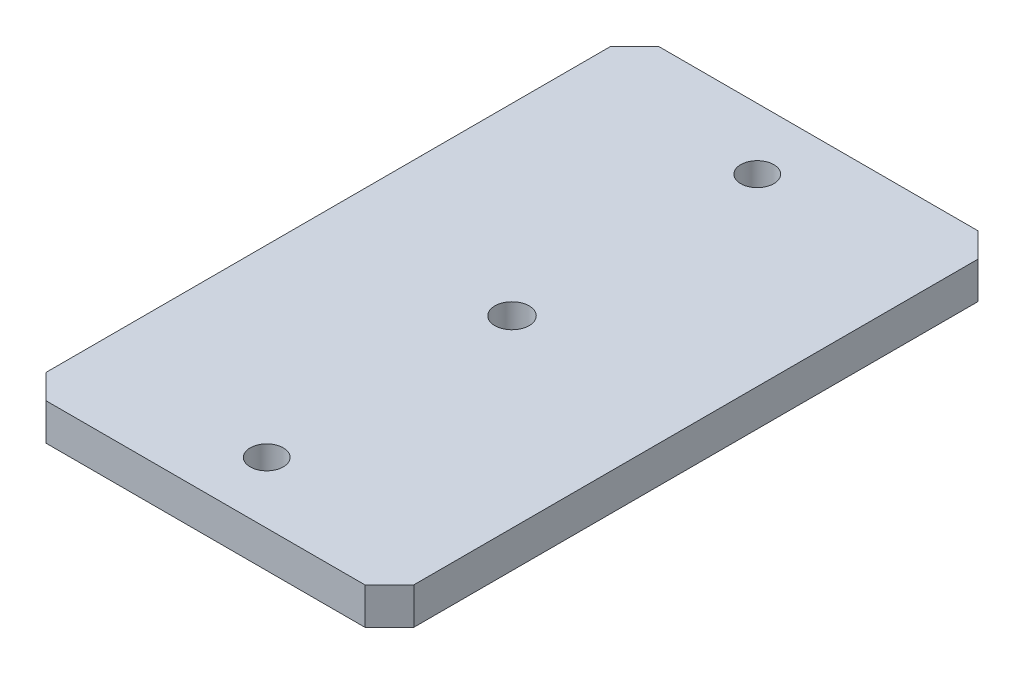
ISO-10303-21;
HEADER;
FILE_DESCRIPTION(('STEP AP214'),'2;1');
FILE_NAME('part.step','',(''),(''),'','','');
FILE_SCHEMA(('AUTOMOTIVE_DESIGN { 1 0 10303 214 1 1 1 1 }'));
ENDSEC;
DATA;
#1=APPLICATION_CONTEXT('core data for automotive mechanical design processes');
#2=APPLICATION_PROTOCOL_DEFINITION('international standard','automotive_design',2000,#1);
#3=PRODUCT_CONTEXT('',#1,'mechanical');
#4=PRODUCT('Part','Part','',(#3));
#5=PRODUCT_RELATED_PRODUCT_CATEGORY('part','',(#4));
#6=PRODUCT_DEFINITION_FORMATION('','',#4);
#7=PRODUCT_DEFINITION_CONTEXT('part definition',#1,'design');
#8=PRODUCT_DEFINITION('design','',#6,#7);
#9=PRODUCT_DEFINITION_SHAPE('','',#8);
#10=(LENGTH_UNIT() NAMED_UNIT(*) SI_UNIT(.MILLI.,.METRE.));
#11=(NAMED_UNIT(*) PLANE_ANGLE_UNIT() SI_UNIT($,.RADIAN.));
#12=(NAMED_UNIT(*) SI_UNIT($,.STERADIAN.) SOLID_ANGLE_UNIT());
#13=UNCERTAINTY_MEASURE_WITH_UNIT(LENGTH_MEASURE(1.E-05),#10,'distance_accuracy_value','');
#14=(GEOMETRIC_REPRESENTATION_CONTEXT(3) GLOBAL_UNCERTAINTY_ASSIGNED_CONTEXT((#13)) GLOBAL_UNIT_ASSIGNED_CONTEXT((#10,
#11,#12)) REPRESENTATION_CONTEXT('',''));
#15=CARTESIAN_POINT('',(0.,0.,0.));
#16=DIRECTION('',(0.,0.,1.));
#17=DIRECTION('',(1.,0.,0.));
#18=AXIS2_PLACEMENT_3D('',#15,#16,#17);
#19=CARTESIAN_POINT('',(-226.912230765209,15.,-125.));
#20=DIRECTION('',(0.,0.,-1.));
#21=DIRECTION('',(-1.,0.,0.));
#22=AXIS2_PLACEMENT_3D('',#19,#20,#21);
#23=PLANE('',#22);
#24=DIRECTION('',(1.,0.,0.));
#25=VECTOR('',#24,1.);
#26=CARTESIAN_POINT('',(-226.912230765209,0.,-125.));
#27=LINE('',#26,#25);
#28=CARTESIAN_POINT('',(-65.,0.,-125.));
#29=VERTEX_POINT('',#28);
#30=CARTESIAN_POINT('',(65.,0.,-125.));
#31=VERTEX_POINT('',#30);
#32=EDGE_CURVE('E123',#29,#31,#27,.T.);
#33=ORIENTED_EDGE('',*,*,#32,.F.);
#34=DIRECTION('',(0.,1.,0.));
#35=VECTOR('',#34,1.);
#36=CARTESIAN_POINT('',(-65.,15.,-125.));
#37=LINE('',#36,#35);
#38=CARTESIAN_POINT('',(-65.,15.,-125.));
#39=VERTEX_POINT('',#38);
#40=EDGE_CURVE('E144',#29,#39,#37,.T.);
#41=ORIENTED_EDGE('',*,*,#40,.T.);
#42=DIRECTION('',(1.,0.,0.));
#43=VECTOR('',#42,1.);
#44=CARTESIAN_POINT('',(-226.912230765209,15.,-125.));
#45=LINE('',#44,#43);
#46=CARTESIAN_POINT('',(64.9999999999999,15.,-125.));
#47=VERTEX_POINT('',#46);
#48=EDGE_CURVE('E161',#39,#47,#45,.T.);
#49=ORIENTED_EDGE('',*,*,#48,.T.);
#50=DIRECTION('',(0.,-1.,0.));
#51=VECTOR('',#50,1.);
#52=CARTESIAN_POINT('',(65.,15.,-125.));
#53=LINE('',#52,#51);
#54=EDGE_CURVE('E141',#47,#31,#53,.T.);
#55=ORIENTED_EDGE('',*,*,#54,.T.);
#56=EDGE_LOOP('',(#33,#41,#49,#55));
#57=FACE_BOUND('',#56,.T.);
#58=ADVANCED_FACE('F36',(#57),#23,.T.);
#59=CARTESIAN_POINT('',(-75.,15.,0.));
#60=DIRECTION('',(-1.,0.,0.));
#61=DIRECTION('',(0.,0.,1.));
#62=AXIS2_PLACEMENT_3D('',#59,#60,#61);
#63=PLANE('',#62);
#64=DIRECTION('',(0.,0.,-1.));
#65=VECTOR('',#64,1.);
#66=CARTESIAN_POINT('',(-75.,15.,0.));
#67=LINE('',#66,#65);
#68=CARTESIAN_POINT('',(-75.,15.,115.));
#69=VERTEX_POINT('',#68);
#70=CARTESIAN_POINT('',(-75.,15.,-115.));
#71=VERTEX_POINT('',#70);
#72=EDGE_CURVE('E159',#69,#71,#67,.T.);
#73=ORIENTED_EDGE('',*,*,#72,.T.);
#74=DIRECTION('',(0.,-1.,0.));
#75=VECTOR('',#74,1.);
#76=CARTESIAN_POINT('',(-75.,15.,-115.));
#77=LINE('',#76,#75);
#78=CARTESIAN_POINT('',(-75.,0.,-115.));
#79=VERTEX_POINT('',#78);
#80=EDGE_CURVE('E122',#71,#79,#77,.T.);
#81=ORIENTED_EDGE('',*,*,#80,.T.);
#82=DIRECTION('',(0.,0.,-1.));
#83=VECTOR('',#82,1.);
#84=CARTESIAN_POINT('',(-75.,0.,0.));
#85=LINE('',#84,#83);
#86=CARTESIAN_POINT('',(-75.,0.,115.));
#87=VERTEX_POINT('',#86);
#88=EDGE_CURVE('E105',#87,#79,#85,.T.);
#89=ORIENTED_EDGE('',*,*,#88,.F.);
#90=DIRECTION('',(0.,1.,0.));
#91=VECTOR('',#90,1.);
#92=CARTESIAN_POINT('',(-75.,15.,115.));
#93=LINE('',#92,#91);
#94=EDGE_CURVE('E119',#87,#69,#93,.T.);
#95=ORIENTED_EDGE('',*,*,#94,.T.);
#96=EDGE_LOOP('',(#73,#81,#89,#95));
#97=FACE_BOUND('',#96,.T.);
#98=ADVANCED_FACE('F118',(#97),#63,.T.);
#99=CARTESIAN_POINT('',(-226.912230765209,15.,125.));
#100=DIRECTION('',(0.,0.,1.));
#101=DIRECTION('',(1.,0.,0.));
#102=AXIS2_PLACEMENT_3D('',#99,#100,#101);
#103=PLANE('',#102);
#104=DIRECTION('',(-1.,0.,0.));
#105=VECTOR('',#104,1.);
#106=CARTESIAN_POINT('',(-226.912230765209,15.,125.));
#107=LINE('',#106,#105);
#108=CARTESIAN_POINT('',(64.9999999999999,15.,125.));
#109=VERTEX_POINT('',#108);
#110=CARTESIAN_POINT('',(-64.9999999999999,15.,125.));
#111=VERTEX_POINT('',#110);
#112=EDGE_CURVE('E132',#109,#111,#107,.T.);
#113=ORIENTED_EDGE('',*,*,#112,.T.);
#114=DIRECTION('',(0.,-1.,0.));
#115=VECTOR('',#114,1.);
#116=CARTESIAN_POINT('',(-65.,15.,125.));
#117=LINE('',#116,#115);
#118=CARTESIAN_POINT('',(-65.,0.,125.));
#119=VERTEX_POINT('',#118);
#120=EDGE_CURVE('E154',#111,#119,#117,.T.);
#121=ORIENTED_EDGE('',*,*,#120,.T.);
#122=DIRECTION('',(-1.,0.,0.));
#123=VECTOR('',#122,1.);
#124=CARTESIAN_POINT('',(-226.912230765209,0.,125.));
#125=LINE('',#124,#123);
#126=CARTESIAN_POINT('',(64.9999999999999,0.,125.));
#127=VERTEX_POINT('',#126);
#128=EDGE_CURVE('E107',#127,#119,#125,.T.);
#129=ORIENTED_EDGE('',*,*,#128,.F.);
#130=DIRECTION('',(0.,1.,0.));
#131=VECTOR('',#130,1.);
#132=CARTESIAN_POINT('',(64.9999999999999,15.,125.));
#133=LINE('',#132,#131);
#134=EDGE_CURVE('E152',#127,#109,#133,.T.);
#135=ORIENTED_EDGE('',*,*,#134,.T.);
#136=EDGE_LOOP('',(#113,#121,#129,#135));
#137=FACE_BOUND('',#136,.T.);
#138=ADVANCED_FACE('F157',(#137),#103,.T.);
#139=CARTESIAN_POINT('',(75.,15.,0.));
#140=DIRECTION('',(1.,0.,0.));
#141=DIRECTION('',(0.,0.,-1.));
#142=AXIS2_PLACEMENT_3D('',#139,#140,#141);
#143=PLANE('',#142);
#144=DIRECTION('',(0.,0.,1.));
#145=VECTOR('',#144,1.);
#146=CARTESIAN_POINT('',(75.,15.,0.));
#147=LINE('',#146,#145);
#148=CARTESIAN_POINT('',(75.,15.,-115.));
#149=VERTEX_POINT('',#148);
#150=CARTESIAN_POINT('',(75.,15.,115.));
#151=VERTEX_POINT('',#150);
#152=EDGE_CURVE('E128',#149,#151,#147,.T.);
#153=ORIENTED_EDGE('',*,*,#152,.T.);
#154=DIRECTION('',(0.,-1.,0.));
#155=VECTOR('',#154,1.);
#156=CARTESIAN_POINT('',(75.,15.,115.));
#157=LINE('',#156,#155);
#158=CARTESIAN_POINT('',(75.,0.,115.));
#159=VERTEX_POINT('',#158);
#160=EDGE_CURVE('E11',#151,#159,#157,.T.);
#161=ORIENTED_EDGE('',*,*,#160,.T.);
#162=DIRECTION('',(0.,0.,1.));
#163=VECTOR('',#162,1.);
#164=CARTESIAN_POINT('',(75.,0.,0.));
#165=LINE('',#164,#163);
#166=CARTESIAN_POINT('',(75.,0.,-115.));
#167=VERTEX_POINT('',#166);
#168=EDGE_CURVE('E135',#167,#159,#165,.T.);
#169=ORIENTED_EDGE('',*,*,#168,.F.);
#170=DIRECTION('',(0.,1.,0.));
#171=VECTOR('',#170,1.);
#172=CARTESIAN_POINT('',(75.,15.,-115.));
#173=LINE('',#172,#171);
#174=EDGE_CURVE('E44',#167,#149,#173,.T.);
#175=ORIENTED_EDGE('',*,*,#174,.T.);
#176=EDGE_LOOP('',(#153,#161,#169,#175));
#177=FACE_BOUND('',#176,.T.);
#178=ADVANCED_FACE('F196',(#177),#143,.T.);
#179=CARTESIAN_POINT('',(-226.912230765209,15.,0.));
#180=DIRECTION('',(0.,1.,0.));
#181=DIRECTION('',(0.,0.,1.));
#182=AXIS2_PLACEMENT_3D('',#179,#180,#181);
#183=PLANE('',#182);
#184=CARTESIAN_POINT('',(0.,15.,0.));
#185=DIRECTION('',(0.,1.,0.));
#186=DIRECTION('',(0.,0.,1.));
#187=AXIS2_PLACEMENT_3D('',#184,#185,#186);
#188=CIRCLE('',#187,6.99999999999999);
#189=CARTESIAN_POINT('',(0.,15.,7.00000000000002));
#190=VERTEX_POINT('',#189);
#191=EDGE_CURVE('E187',#190,#190,#188,.T.);
#192=ORIENTED_EDGE('',*,*,#191,.F.);
#193=EDGE_LOOP('',(#192));
#194=FACE_BOUND('',#193,.T.);
#195=CARTESIAN_POINT('',(0.,15.,100.));
#196=DIRECTION('',(0.,1.,0.));
#197=DIRECTION('',(0.,0.,1.));
#198=AXIS2_PLACEMENT_3D('',#195,#196,#197);
#199=CIRCLE('',#198,6.74999999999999);
#200=CARTESIAN_POINT('',(0.,15.,106.75));
#201=VERTEX_POINT('',#200);
#202=EDGE_CURVE('E181',#201,#201,#199,.T.);
#203=ORIENTED_EDGE('',*,*,#202,.F.);
#204=EDGE_LOOP('',(#203));
#205=FACE_BOUND('',#204,.T.);
#206=CARTESIAN_POINT('',(0.,15.,-100.));
#207=DIRECTION('',(0.,1.,0.));
#208=DIRECTION('',(0.,0.,1.));
#209=AXIS2_PLACEMENT_3D('',#206,#207,#208);
#210=CIRCLE('',#209,6.74999999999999);
#211=CARTESIAN_POINT('',(0.,15.,-93.25));
#212=VERTEX_POINT('',#211);
#213=EDGE_CURVE('E175',#212,#212,#210,.T.);
#214=ORIENTED_EDGE('',*,*,#213,.F.);
#215=EDGE_LOOP('',(#214));
#216=FACE_BOUND('',#215,.T.);
#217=ORIENTED_EDGE('',*,*,#48,.F.);
#218=DIRECTION('',(0.70710678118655,0.,-0.707106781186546));
#219=VECTOR('',#218,1.);
#220=CARTESIAN_POINT('',(-208.456115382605,15.,18.456115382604));
#221=LINE('',#220,#219);
#222=EDGE_CURVE('E150',#39,#71,#221,.F.);
#223=ORIENTED_EDGE('',*,*,#222,.T.);
#224=ORIENTED_EDGE('',*,*,#72,.F.);
#225=DIRECTION('',(-0.707106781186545,0.,-0.70710678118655));
#226=VECTOR('',#225,1.);
#227=CARTESIAN_POINT('',(-208.456115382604,15.,-18.4561153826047));
#228=LINE('',#227,#226);
#229=EDGE_CURVE('E127',#69,#111,#228,.F.);
#230=ORIENTED_EDGE('',*,*,#229,.T.);
#231=ORIENTED_EDGE('',*,*,#112,.F.);
#232=DIRECTION('',(-0.707106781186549,0.,0.707106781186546));
#233=VECTOR('',#232,1.);
#234=CARTESIAN_POINT('',(-18.456115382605,15.,208.456115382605));
#235=LINE('',#234,#233);
#236=EDGE_CURVE('E51',#109,#151,#235,.F.);
#237=ORIENTED_EDGE('',*,*,#236,.T.);
#238=ORIENTED_EDGE('',*,*,#152,.F.);
#239=DIRECTION('',(0.707106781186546,0.,0.707106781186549));
#240=VECTOR('',#239,1.);
#241=CARTESIAN_POINT('',(-18.4561153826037,15.,-208.456115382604));
#242=LINE('',#241,#240);
#243=EDGE_CURVE('E146',#149,#47,#242,.F.);
#244=ORIENTED_EDGE('',*,*,#243,.T.);
#245=EDGE_LOOP('',(#217,#223,#224,#230,#231,#237,#238,#244));
#246=FACE_BOUND('',#245,.T.);
#247=ADVANCED_FACE('F193',(#194,#205,#216,#246),#183,.T.);
#248=CARTESIAN_POINT('',(-226.912230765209,0.,0.));
#249=DIRECTION('',(0.,1.,0.));
#250=DIRECTION('',(0.,0.,1.));
#251=AXIS2_PLACEMENT_3D('',#248,#249,#250);
#252=PLANE('',#251);
#253=CARTESIAN_POINT('',(0.,0.,0.));
#254=DIRECTION('',(0.,1.,0.));
#255=DIRECTION('',(0.,0.,1.));
#256=AXIS2_PLACEMENT_3D('',#253,#254,#255);
#257=CIRCLE('',#256,6.99999999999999);
#258=CARTESIAN_POINT('',(0.,0.,7.00000000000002));
#259=VERTEX_POINT('',#258);
#260=EDGE_CURVE('E184',#259,#259,#257,.T.);
#261=ORIENTED_EDGE('',*,*,#260,.T.);
#262=EDGE_LOOP('',(#261));
#263=FACE_BOUND('',#262,.T.);
#264=CARTESIAN_POINT('',(0.,0.,100.));
#265=DIRECTION('',(0.,1.,0.));
#266=DIRECTION('',(0.,0.,1.));
#267=AXIS2_PLACEMENT_3D('',#264,#265,#266);
#268=CIRCLE('',#267,6.75);
#269=CARTESIAN_POINT('',(0.,0.,106.75));
#270=VERTEX_POINT('',#269);
#271=EDGE_CURVE('E178',#270,#270,#268,.T.);
#272=ORIENTED_EDGE('',*,*,#271,.T.);
#273=EDGE_LOOP('',(#272));
#274=FACE_BOUND('',#273,.T.);
#275=CARTESIAN_POINT('',(0.,0.,-100.));
#276=DIRECTION('',(0.,1.,0.));
#277=DIRECTION('',(0.,0.,1.));
#278=AXIS2_PLACEMENT_3D('',#275,#276,#277);
#279=CIRCLE('',#278,6.75);
#280=CARTESIAN_POINT('',(0.,0.,-93.25));
#281=VERTEX_POINT('',#280);
#282=EDGE_CURVE('E166',#281,#281,#279,.T.);
#283=ORIENTED_EDGE('',*,*,#282,.T.);
#284=EDGE_LOOP('',(#283));
#285=FACE_BOUND('',#284,.T.);
#286=ORIENTED_EDGE('',*,*,#88,.T.);
#287=DIRECTION('',(-0.70710678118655,0.,0.707106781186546));
#288=VECTOR('',#287,1.);
#289=CARTESIAN_POINT('',(-75.,0.,-115.));
#290=LINE('',#289,#288);
#291=EDGE_CURVE('E112',#79,#29,#290,.F.);
#292=ORIENTED_EDGE('',*,*,#291,.T.);
#293=ORIENTED_EDGE('',*,*,#32,.T.);
#294=DIRECTION('',(-0.707106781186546,0.,-0.707106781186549));
#295=VECTOR('',#294,1.);
#296=CARTESIAN_POINT('',(65.,0.,-125.));
#297=LINE('',#296,#295);
#298=EDGE_CURVE('E130',#31,#167,#297,.F.);
#299=ORIENTED_EDGE('',*,*,#298,.T.);
#300=ORIENTED_EDGE('',*,*,#168,.T.);
#301=DIRECTION('',(0.707106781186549,0.,-0.707106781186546));
#302=VECTOR('',#301,1.);
#303=CARTESIAN_POINT('',(75.,0.,115.));
#304=LINE('',#303,#302);
#305=EDGE_CURVE('E113',#159,#127,#304,.F.);
#306=ORIENTED_EDGE('',*,*,#305,.T.);
#307=ORIENTED_EDGE('',*,*,#128,.T.);
#308=DIRECTION('',(0.707106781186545,0.,0.70710678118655));
#309=VECTOR('',#308,1.);
#310=CARTESIAN_POINT('',(-65.,0.,125.));
#311=LINE('',#310,#309);
#312=EDGE_CURVE('E102',#119,#87,#311,.F.);
#313=ORIENTED_EDGE('',*,*,#312,.T.);
#314=EDGE_LOOP('',(#286,#292,#293,#299,#300,#306,#307,#313));
#315=FACE_BOUND('',#314,.T.);
#316=ADVANCED_FACE('F104',(#263,#274,#285,#315),#252,.F.);
#317=CARTESIAN_POINT('',(0.,15.,-100.));
#318=DIRECTION('',(0.,1.,0.));
#319=DIRECTION('',(0.,0.,1.));
#320=AXIS2_PLACEMENT_3D('',#317,#318,#319);
#321=CYLINDRICAL_SURFACE('',#320,6.74999999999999);
#322=ORIENTED_EDGE('',*,*,#282,.F.);
#323=EDGE_LOOP('',(#322));
#324=FACE_BOUND('',#323,.T.);
#325=ORIENTED_EDGE('',*,*,#213,.T.);
#326=EDGE_LOOP('',(#325));
#327=FACE_BOUND('',#326,.T.);
#328=ADVANCED_FACE('F235',(#324,#327),#321,.F.);
#329=CARTESIAN_POINT('',(0.,15.,100.));
#330=DIRECTION('',(0.,1.,0.));
#331=DIRECTION('',(0.,0.,1.));
#332=AXIS2_PLACEMENT_3D('',#329,#330,#331);
#333=CYLINDRICAL_SURFACE('',#332,6.74999999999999);
#334=ORIENTED_EDGE('',*,*,#271,.F.);
#335=EDGE_LOOP('',(#334));
#336=FACE_BOUND('',#335,.T.);
#337=ORIENTED_EDGE('',*,*,#202,.T.);
#338=EDGE_LOOP('',(#337));
#339=FACE_BOUND('',#338,.T.);
#340=ADVANCED_FACE('F229',(#336,#339),#333,.F.);
#341=CARTESIAN_POINT('',(0.,15.,0.));
#342=DIRECTION('',(0.,1.,0.));
#343=DIRECTION('',(0.,0.,1.));
#344=AXIS2_PLACEMENT_3D('',#341,#342,#343);
#345=CYLINDRICAL_SURFACE('',#344,6.99999999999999);
#346=ORIENTED_EDGE('',*,*,#260,.F.);
#347=EDGE_LOOP('',(#346));
#348=FACE_BOUND('',#347,.T.);
#349=ORIENTED_EDGE('',*,*,#191,.T.);
#350=EDGE_LOOP('',(#349));
#351=FACE_BOUND('',#350,.T.);
#352=ADVANCED_FACE('F191',(#348,#351),#345,.F.);
#353=CARTESIAN_POINT('',(-75.,15.,-115.));
#354=DIRECTION('',(0.707106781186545,0.,0.707106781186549));
#355=DIRECTION('',(0.70710678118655,0.,-0.707106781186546));
#356=AXIS2_PLACEMENT_3D('',#353,#354,#355);
#357=PLANE('',#356);
#358=ORIENTED_EDGE('',*,*,#222,.F.);
#359=ORIENTED_EDGE('',*,*,#40,.F.);
#360=ORIENTED_EDGE('',*,*,#291,.F.);
#361=ORIENTED_EDGE('',*,*,#80,.F.);
#362=EDGE_LOOP('',(#358,#359,#360,#361));
#363=FACE_BOUND('',#362,.T.);
#364=ADVANCED_FACE('F205',(#363),#357,.F.);
#365=CARTESIAN_POINT('',(-65.,15.,125.));
#366=DIRECTION('',(0.70710678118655,0.,-0.707106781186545));
#367=DIRECTION('',(-0.707106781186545,0.,-0.70710678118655));
#368=AXIS2_PLACEMENT_3D('',#365,#366,#367);
#369=PLANE('',#368);
#370=ORIENTED_EDGE('',*,*,#229,.F.);
#371=ORIENTED_EDGE('',*,*,#94,.F.);
#372=ORIENTED_EDGE('',*,*,#312,.F.);
#373=ORIENTED_EDGE('',*,*,#120,.F.);
#374=EDGE_LOOP('',(#370,#371,#372,#373));
#375=FACE_BOUND('',#374,.T.);
#376=ADVANCED_FACE('F126',(#375),#369,.F.);
#377=CARTESIAN_POINT('',(75.,15.,115.));
#378=DIRECTION('',(-0.707106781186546,0.,-0.707106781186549));
#379=DIRECTION('',(-0.707106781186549,0.,0.707106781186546));
#380=AXIS2_PLACEMENT_3D('',#377,#378,#379);
#381=PLANE('',#380);
#382=ORIENTED_EDGE('',*,*,#236,.F.);
#383=ORIENTED_EDGE('',*,*,#134,.F.);
#384=ORIENTED_EDGE('',*,*,#305,.F.);
#385=ORIENTED_EDGE('',*,*,#160,.F.);
#386=EDGE_LOOP('',(#382,#383,#384,#385));
#387=FACE_BOUND('',#386,.T.);
#388=ADVANCED_FACE('F210',(#387),#381,.F.);
#389=CARTESIAN_POINT('',(65.,15.,-125.));
#390=DIRECTION('',(-0.707106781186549,0.,0.707106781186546));
#391=DIRECTION('',(0.707106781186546,0.,0.707106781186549));
#392=AXIS2_PLACEMENT_3D('',#389,#390,#391);
#393=PLANE('',#392);
#394=ORIENTED_EDGE('',*,*,#243,.F.);
#395=ORIENTED_EDGE('',*,*,#174,.F.);
#396=ORIENTED_EDGE('',*,*,#298,.F.);
#397=ORIENTED_EDGE('',*,*,#54,.F.);
#398=EDGE_LOOP('',(#394,#395,#396,#397));
#399=FACE_BOUND('',#398,.T.);
#400=ADVANCED_FACE('F38',(#399),#393,.F.);
#401=CLOSED_SHELL('',(#58,#98,#138,#178,#247,#316,#328,#340,#352,#364,#376,#388,#400));
#402=MANIFOLD_SOLID_BREP('B2',#401);
#403=ADVANCED_BREP_SHAPE_REPRESENTATION('',(#18,#402),#14);
#404=SHAPE_DEFINITION_REPRESENTATION(#9,#403);
ENDSEC;
END-ISO-10303-21;
